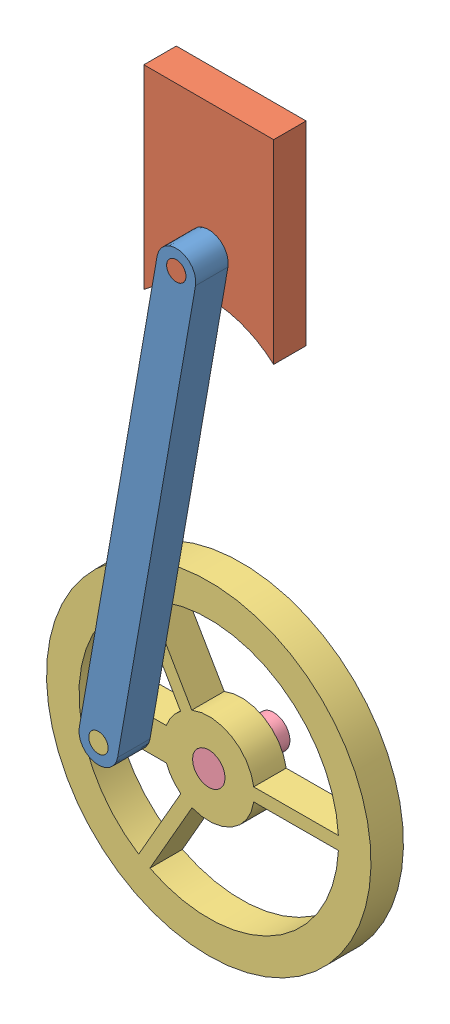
SolidWorks assembly Assem2.SLDASM, configuration Default (file format 7000). Lengths in mm.
Overall size (50.15 114 15).
4 component instances, 4 part files, 11 mates.
Components (placement in the parent):
- Block-Connecting Rod1-1-17-1: Block-Connecting Rod1-1-17.sldprt [Default] at (-6 34.4457 0) x (0.171428 0.985197 0) z (0 0 1) size (76 6 5)
- Block-Slider1-1-18-1: Block-Slider1-1-18.sldprt [Default] at (0 73.9276 0) size (20 30 10)
- Block-Wheel1-1-19-1: Block-Wheel1-1-19.sldprt [Default] x (0.003017 -0.999995 0) z (0 0 1) size (50 50 10)
- Block-Shaft1-1-20-1: Block-Shaft1-1-20.sldprt [Default] x (-0.907768 0.419473 0) z (0 0 1) size (5 5 10)
Mates (geometry in assembly coordinates):
- Coincident4: coincident aligned: circle of Block-Wheel1-1-19-1; circle of assembly
- Coincident7: coincident aligned: line of Block-Wheel1-1-19-1 through (19.9779 -0.9397 0) axis (-0.999995 -0.003017 0); line of assembly
- Concentric6: concentric aligned: cylinder of Block-Wheel1-1-19-1 through (0 0 -10) axis (0 0 1) radius 2.5; cylinder of Block-Shaft1-1-20-1 through (0 0 -10) axis (0 0 1) radius 2.5
- Coincident8: coincident anti-aligned: cylinder of Block-Connecting Rod1-1-17-1 through (-11.9999 -0.0362 5) axis (0 0 -1) radius 1.5; circle of assembly
- Concentric7: concentric aligned: cylinder of Block-Connecting Rod1-1-17-1 through (0 68.9276 5) axis (0 0 -1) radius 1.5; cylinder of Block-Slider1-1-18-1 through (0 68.9276 5) axis (0 0 -1) radius 1.5
- Concentric9: concentric aligned: cylinder of Block-Wheel1-1-19-1 through (0 0 -5) axis (0 0 1) radius 25; circle of assembly
- Coincident12: coincident anti-aligned: cylinder of Block-Connecting Rod1-1-17-1 through (0 68.9276 5) axis (0 0 -1) radius 1.5; circle of assembly
- Concentric10: concentric aligned: cylinder of Block-Connecting Rod1-1-17-1 through (0 68.9276 5) axis (0 0 -1) radius 1.5; cylinder of Block-Slider1-1-18-1 through (0 68.9276 5) axis (0 0 -1) radius 1.5
- Coincident13: coincident: plane of Block-Slider1-1-18-1 through (0 47.7472 0) normal (0 0 1); line of assembly
- Coincident14: coincident aligned: line of Block-Slider1-1-18-1 through (-10 88.9276 0) axis (0 -1 0)
- Layout: Part-Block Fixed40: unknown: line of Block-Shaft1-1-20-1 through (-1.3272 -0.4883 0) axis (-0.907768 0.419473 0); line of Block-Shaft1-1-20-1 through (-1.3272 -0.4883 0) axis (-0.419473 -0.907768 0)
